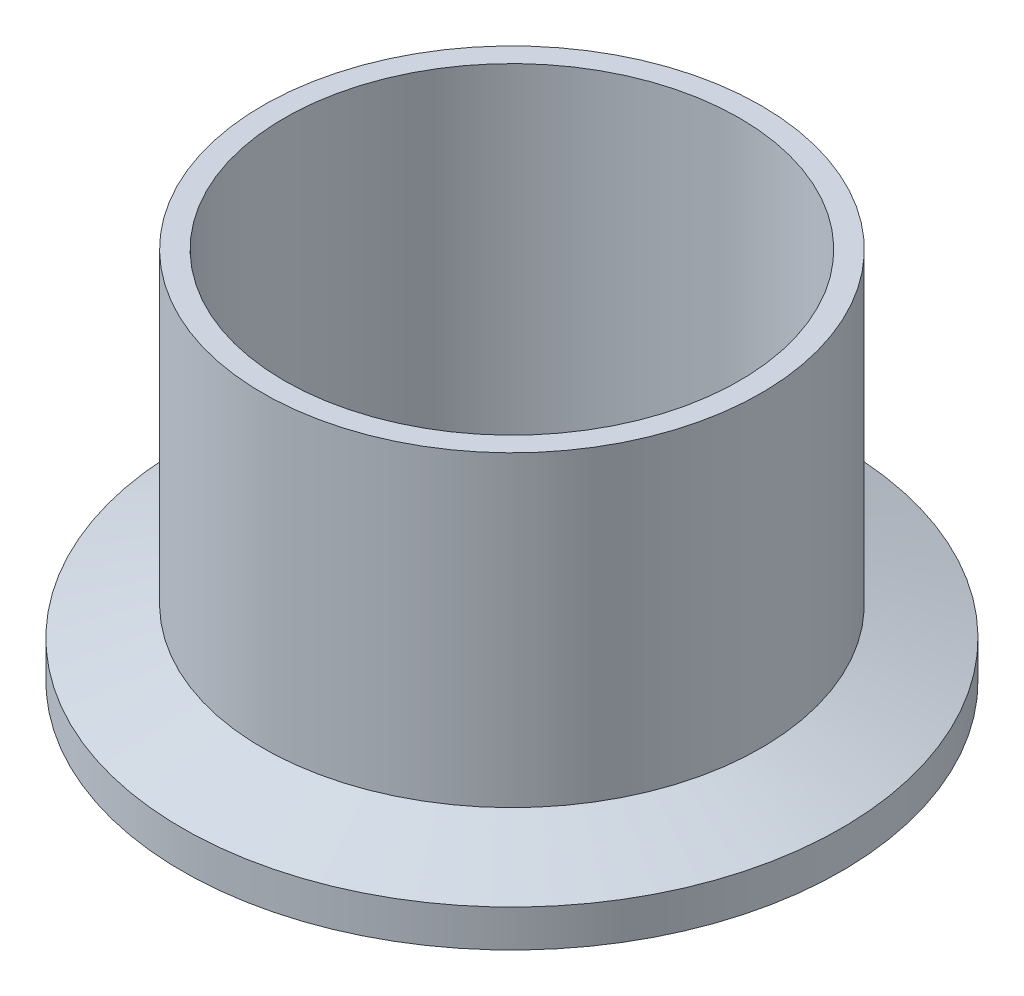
ISO-10303-21;
HEADER;
FILE_DESCRIPTION(('STEP AP214'),'2;1');
FILE_NAME('part.step','',(''),(''),'','','');
FILE_SCHEMA(('AUTOMOTIVE_DESIGN { 1 0 10303 214 1 1 1 1 }'));
ENDSEC;
DATA;
#1=APPLICATION_CONTEXT('core data for automotive mechanical design processes');
#2=APPLICATION_PROTOCOL_DEFINITION('international standard','automotive_design',2000,#1);
#3=PRODUCT_CONTEXT('',#1,'mechanical');
#4=PRODUCT('Part','Part','',(#3));
#5=PRODUCT_RELATED_PRODUCT_CATEGORY('part','',(#4));
#6=PRODUCT_DEFINITION_FORMATION('','',#4);
#7=PRODUCT_DEFINITION_CONTEXT('part definition',#1,'design');
#8=PRODUCT_DEFINITION('design','',#6,#7);
#9=PRODUCT_DEFINITION_SHAPE('','',#8);
#10=(LENGTH_UNIT() NAMED_UNIT(*) SI_UNIT(.MILLI.,.METRE.));
#11=(NAMED_UNIT(*) PLANE_ANGLE_UNIT() SI_UNIT($,.RADIAN.));
#12=(NAMED_UNIT(*) SI_UNIT($,.STERADIAN.) SOLID_ANGLE_UNIT());
#13=UNCERTAINTY_MEASURE_WITH_UNIT(LENGTH_MEASURE(1.E-05),#10,'distance_accuracy_value','');
#14=(GEOMETRIC_REPRESENTATION_CONTEXT(3) GLOBAL_UNCERTAINTY_ASSIGNED_CONTEXT((#13)) GLOBAL_UNIT_ASSIGNED_CONTEXT((#10,
#11,#12)) REPRESENTATION_CONTEXT('',''));
#15=CARTESIAN_POINT('',(0.,0.,0.));
#16=DIRECTION('',(0.,0.,1.));
#17=DIRECTION('',(1.,0.,0.));
#18=AXIS2_PLACEMENT_3D('',#15,#16,#17);
#19=CARTESIAN_POINT('',(0.,0.787400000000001,0.));
#20=DIRECTION('',(0.,-1.,0.));
#21=DIRECTION('',(0.,0.,-1.));
#22=AXIS2_PLACEMENT_3D('',#19,#20,#21);
#23=TOROIDAL_SURFACE('',#22,23.6366084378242,0.787399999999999);
#24=CARTESIAN_POINT('',(0.,0.,0.));
#25=DIRECTION('',(0.,-1.,0.));
#26=DIRECTION('',(0.,0.,-1.));
#27=AXIS2_PLACEMENT_3D('',#24,#25,#26);
#28=CIRCLE('',#27,23.6366084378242);
#29=CARTESIAN_POINT('',(0.,0.,-23.6366084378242));
#30=VERTEX_POINT('',#29);
#31=EDGE_CURVE('E62',#30,#30,#28,.T.);
#32=ORIENTED_EDGE('',*,*,#31,.T.);
#33=EDGE_LOOP('',(#32));
#34=FACE_BOUND('',#33,.T.);
#35=CARTESIAN_POINT('',(0.,0.474458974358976,0.));
#36=DIRECTION('',(0.,-1.,0.));
#37=DIRECTION('',(0.,0.,-1.));
#38=AXIS2_PLACEMENT_3D('',#35,#36,#37);
#39=CIRCLE('',#38,22.9140666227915);
#40=CARTESIAN_POINT('',(0.,0.474458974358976,-22.9140666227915));
#41=VERTEX_POINT('',#40);
#42=EDGE_CURVE('E10',#41,#41,#39,.T.);
#43=ORIENTED_EDGE('',*,*,#42,.F.);
#44=EDGE_LOOP('',(#43));
#45=FACE_BOUND('',#44,.T.);
#46=ADVANCED_FACE('F28',(#34,#45),#23,.T.);
#47=CARTESIAN_POINT('',(0.,0.,0.));
#48=DIRECTION('',(0.,-1.,0.));
#49=DIRECTION('',(0.,0.,-1.));
#50=AXIS2_PLACEMENT_3D('',#47,#48,#49);
#51=TOROIDAL_SURFACE('',#50,21.8186,1.1938);
#52=CARTESIAN_POINT('',(0.,0.474458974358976,0.));
#53=DIRECTION('',(0.,-1.,0.));
#54=DIRECTION('',(0.,0.,-1.));
#55=AXIS2_PLACEMENT_3D('',#52,#53,#54);
#56=CIRCLE('',#55,20.7231333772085);
#57=CARTESIAN_POINT('',(0.,0.474458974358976,-20.7231333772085));
#58=VERTEX_POINT('',#57);
#59=EDGE_CURVE('E34',#58,#58,#56,.T.);
#60=ORIENTED_EDGE('',*,*,#59,.F.);
#61=EDGE_LOOP('',(#60));
#62=FACE_BOUND('',#61,.T.);
#63=ORIENTED_EDGE('',*,*,#42,.T.);
#64=EDGE_LOOP('',(#63));
#65=FACE_BOUND('',#64,.T.);
#66=ADVANCED_FACE('F110',(#62,#65),#51,.F.);
#67=CARTESIAN_POINT('',(0.,0.787400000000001,0.));
#68=DIRECTION('',(0.,-1.,0.));
#69=DIRECTION('',(0.,0.,-1.));
#70=AXIS2_PLACEMENT_3D('',#67,#68,#69);
#71=TOROIDAL_SURFACE('',#70,20.0005915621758,0.787399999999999);
#72=ORIENTED_EDGE('',*,*,#59,.T.);
#73=EDGE_LOOP('',(#72));
#74=FACE_BOUND('',#73,.T.);
#75=CARTESIAN_POINT('',(0.,0.,0.));
#76=DIRECTION('',(0.,-1.,0.));
#77=DIRECTION('',(0.,0.,-1.));
#78=AXIS2_PLACEMENT_3D('',#75,#76,#77);
#79=CIRCLE('',#78,20.0005915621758);
#80=CARTESIAN_POINT('',(0.,0.,-20.0005915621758));
#81=VERTEX_POINT('',#80);
#82=EDGE_CURVE('E38',#81,#81,#79,.T.);
#83=ORIENTED_EDGE('',*,*,#82,.F.);
#84=EDGE_LOOP('',(#83));
#85=FACE_BOUND('',#84,.T.);
#86=ADVANCED_FACE('F106',(#74,#85),#71,.T.);
#87=CARTESIAN_POINT('',(0.,0.,0.));
#88=DIRECTION('',(0.,1.,0.));
#89=DIRECTION('',(0.,0.,1.));
#90=AXIS2_PLACEMENT_3D('',#87,#88,#89);
#91=PLANE('',#90);
#92=CARTESIAN_POINT('',(0.,0.,0.));
#93=DIRECTION('',(0.,-1.,0.));
#94=DIRECTION('',(0.,0.,-1.));
#95=AXIS2_PLACEMENT_3D('',#92,#93,#94);
#96=CIRCLE('',#95,17.399);
#97=CARTESIAN_POINT('',(0.,0.,-17.399));
#98=VERTEX_POINT('',#97);
#99=EDGE_CURVE('E42',#98,#98,#96,.T.);
#100=ORIENTED_EDGE('',*,*,#99,.F.);
#101=EDGE_LOOP('',(#100));
#102=FACE_BOUND('',#101,.T.);
#103=ORIENTED_EDGE('',*,*,#82,.T.);
#104=EDGE_LOOP('',(#103));
#105=FACE_BOUND('',#104,.T.);
#106=ADVANCED_FACE('F100',(#102,#105),#91,.F.);
#107=CARTESIAN_POINT('',(0.,0.,0.));
#108=DIRECTION('',(0.,-1.,0.));
#109=DIRECTION('',(0.,0.,-1.));
#110=AXIS2_PLACEMENT_3D('',#107,#108,#109);
#111=CYLINDRICAL_SURFACE('',#110,17.399);
#112=ORIENTED_EDGE('',*,*,#99,.T.);
#113=EDGE_LOOP('',(#112));
#114=FACE_BOUND('',#113,.T.);
#115=CARTESIAN_POINT('',(0.,28.575,0.));
#116=DIRECTION('',(0.,-1.,0.));
#117=DIRECTION('',(0.,0.,-1.));
#118=AXIS2_PLACEMENT_3D('',#115,#116,#117);
#119=CIRCLE('',#118,17.399);
#120=CARTESIAN_POINT('',(0.,28.575,-17.399));
#121=VERTEX_POINT('',#120);
#122=EDGE_CURVE('E47',#121,#121,#119,.T.);
#123=ORIENTED_EDGE('',*,*,#122,.F.);
#124=EDGE_LOOP('',(#123));
#125=FACE_BOUND('',#124,.T.);
#126=ADVANCED_FACE('F95',(#114,#125),#111,.F.);
#127=CARTESIAN_POINT('',(0.,28.575,0.));
#128=DIRECTION('',(0.,-1.,0.));
#129=DIRECTION('',(0.,0.,-1.));
#130=AXIS2_PLACEMENT_3D('',#127,#128,#129);
#131=PLANE('',#130);
#132=CARTESIAN_POINT('',(0.,28.575,0.));
#133=DIRECTION('',(0.,-1.,0.));
#134=DIRECTION('',(0.,0.,-1.));
#135=AXIS2_PLACEMENT_3D('',#132,#133,#134);
#136=CIRCLE('',#135,19.05);
#137=CARTESIAN_POINT('',(0.,28.575,-19.05));
#138=VERTEX_POINT('',#137);
#139=EDGE_CURVE('E50',#138,#138,#136,.T.);
#140=ORIENTED_EDGE('',*,*,#139,.F.);
#141=EDGE_LOOP('',(#140));
#142=FACE_BOUND('',#141,.T.);
#143=ORIENTED_EDGE('',*,*,#122,.T.);
#144=EDGE_LOOP('',(#143));
#145=FACE_BOUND('',#144,.T.);
#146=ADVANCED_FACE('F89',(#142,#145),#131,.F.);
#147=CARTESIAN_POINT('',(0.,0.,0.));
#148=DIRECTION('',(0.,-1.,0.));
#149=DIRECTION('',(0.,0.,-1.));
#150=AXIS2_PLACEMENT_3D('',#147,#148,#149);
#151=CYLINDRICAL_SURFACE('',#150,19.05);
#152=CARTESIAN_POINT('',(0.,5.08205223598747,0.));
#153=DIRECTION('',(0.,-1.,0.));
#154=DIRECTION('',(0.,0.,-1.));
#155=AXIS2_PLACEMENT_3D('',#152,#153,#154);
#156=CIRCLE('',#155,19.05);
#157=CARTESIAN_POINT('',(0.,5.08205223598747,-19.05));
#158=VERTEX_POINT('',#157);
#159=EDGE_CURVE('E53',#158,#158,#156,.T.);
#160=ORIENTED_EDGE('',*,*,#159,.F.);
#161=EDGE_LOOP('',(#160));
#162=FACE_BOUND('',#161,.T.);
#163=ORIENTED_EDGE('',*,*,#139,.T.);
#164=EDGE_LOOP('',(#163));
#165=FACE_BOUND('',#164,.T.);
#166=ADVANCED_FACE('F83',(#162,#165),#151,.T.);
#167=CARTESIAN_POINT('',(0.,5.08205223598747,0.));
#168=DIRECTION('',(0.,-1.,0.));
#169=DIRECTION('',(0.,0.,-1.));
#170=AXIS2_PLACEMENT_3D('',#167,#168,#169);
#171=CONICAL_SURFACE('',#170,19.05,1.22173047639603);
#172=CARTESIAN_POINT('',(0.,2.8448,0.));
#173=DIRECTION('',(0.,-1.,0.));
#174=DIRECTION('',(0.,0.,-1.));
#175=AXIS2_PLACEMENT_3D('',#172,#173,#174);
#176=CIRCLE('',#175,25.1968);
#177=CARTESIAN_POINT('',(0.,2.8448,-25.1968));
#178=VERTEX_POINT('',#177);
#179=EDGE_CURVE('E56',#178,#178,#176,.T.);
#180=ORIENTED_EDGE('',*,*,#179,.F.);
#181=EDGE_LOOP('',(#180));
#182=FACE_BOUND('',#181,.T.);
#183=ORIENTED_EDGE('',*,*,#159,.T.);
#184=EDGE_LOOP('',(#183));
#185=FACE_BOUND('',#184,.T.);
#186=ADVANCED_FACE('F77',(#182,#185),#171,.T.);
#187=CARTESIAN_POINT('',(0.,0.,0.));
#188=DIRECTION('',(0.,-1.,0.));
#189=DIRECTION('',(0.,0.,-1.));
#190=AXIS2_PLACEMENT_3D('',#187,#188,#189);
#191=CYLINDRICAL_SURFACE('',#190,25.1968);
#192=CARTESIAN_POINT('',(0.,0.,0.));
#193=DIRECTION('',(0.,-1.,0.));
#194=DIRECTION('',(0.,0.,-1.));
#195=AXIS2_PLACEMENT_3D('',#192,#193,#194);
#196=CIRCLE('',#195,25.1968);
#197=CARTESIAN_POINT('',(0.,0.,-25.1968));
#198=VERTEX_POINT('',#197);
#199=EDGE_CURVE('E59',#198,#198,#196,.T.);
#200=ORIENTED_EDGE('',*,*,#199,.F.);
#201=EDGE_LOOP('',(#200));
#202=FACE_BOUND('',#201,.T.);
#203=ORIENTED_EDGE('',*,*,#179,.T.);
#204=EDGE_LOOP('',(#203));
#205=FACE_BOUND('',#204,.T.);
#206=ADVANCED_FACE('F71',(#202,#205),#191,.T.);
#207=CARTESIAN_POINT('',(0.,0.,0.));
#208=DIRECTION('',(0.,1.,0.));
#209=DIRECTION('',(0.,0.,1.));
#210=AXIS2_PLACEMENT_3D('',#207,#208,#209);
#211=PLANE('',#210);
#212=ORIENTED_EDGE('',*,*,#31,.F.);
#213=EDGE_LOOP('',(#212));
#214=FACE_BOUND('',#213,.T.);
#215=ORIENTED_EDGE('',*,*,#199,.T.);
#216=EDGE_LOOP('',(#215));
#217=FACE_BOUND('',#216,.T.);
#218=ADVANCED_FACE('F68',(#214,#217),#211,.F.);
#219=CLOSED_SHELL('',(#46,#66,#86,#106,#126,#146,#166,#186,#206,#218));
#220=MANIFOLD_SOLID_BREP('B2',#219);
#221=ADVANCED_BREP_SHAPE_REPRESENTATION('',(#18,#220),#14);
#222=SHAPE_DEFINITION_REPRESENTATION(#9,#221);
ENDSEC;
END-ISO-10303-21;
